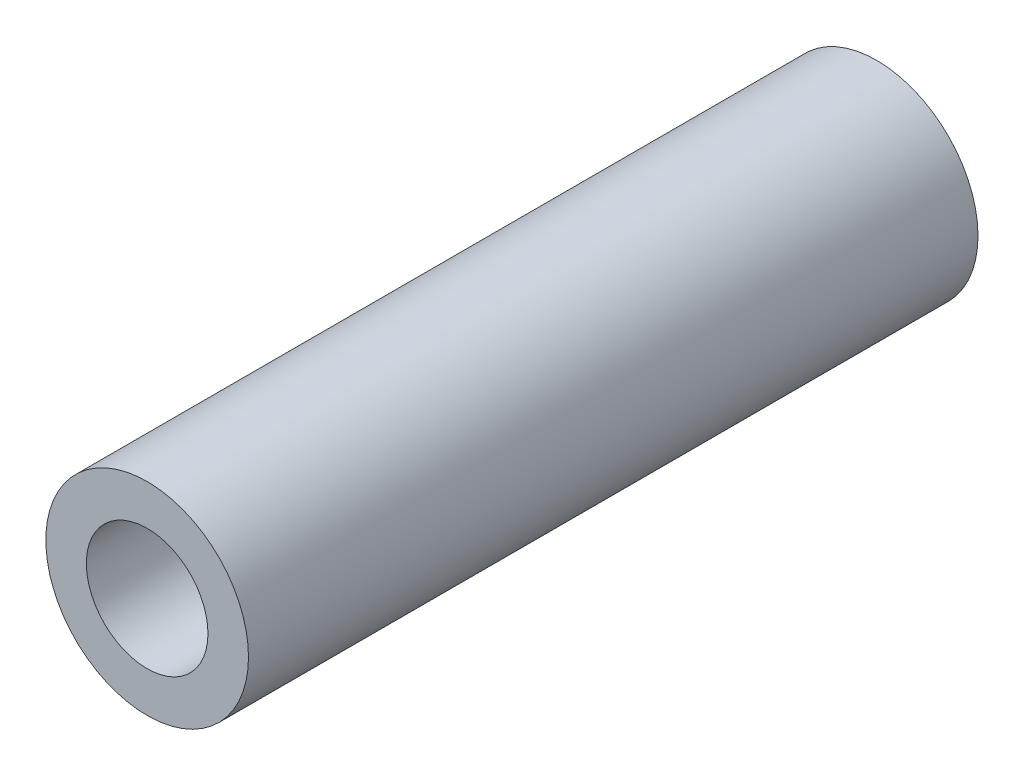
ISO-10303-21;
HEADER;
FILE_DESCRIPTION(('STEP AP214'),'2;1');
FILE_NAME('part.step','',(''),(''),'','','');
FILE_SCHEMA(('AUTOMOTIVE_DESIGN { 1 0 10303 214 1 1 1 1 }'));
ENDSEC;
DATA;
#1=APPLICATION_CONTEXT('core data for automotive mechanical design processes');
#2=APPLICATION_PROTOCOL_DEFINITION('international standard','automotive_design',2000,#1);
#3=PRODUCT_CONTEXT('',#1,'mechanical');
#4=PRODUCT('Part','Part','',(#3));
#5=PRODUCT_RELATED_PRODUCT_CATEGORY('part','',(#4));
#6=PRODUCT_DEFINITION_FORMATION('','',#4);
#7=PRODUCT_DEFINITION_CONTEXT('part definition',#1,'design');
#8=PRODUCT_DEFINITION('design','',#6,#7);
#9=PRODUCT_DEFINITION_SHAPE('','',#8);
#10=(LENGTH_UNIT() NAMED_UNIT(*) SI_UNIT(.MILLI.,.METRE.));
#11=(NAMED_UNIT(*) PLANE_ANGLE_UNIT() SI_UNIT($,.RADIAN.));
#12=(NAMED_UNIT(*) SI_UNIT($,.STERADIAN.) SOLID_ANGLE_UNIT());
#13=UNCERTAINTY_MEASURE_WITH_UNIT(LENGTH_MEASURE(1.E-05),#10,'distance_accuracy_value','');
#14=(GEOMETRIC_REPRESENTATION_CONTEXT(3) GLOBAL_UNCERTAINTY_ASSIGNED_CONTEXT((#13)) GLOBAL_UNIT_ASSIGNED_CONTEXT((#10,
#11,#12)) REPRESENTATION_CONTEXT('',''));
#15=CARTESIAN_POINT('',(0.,0.,0.));
#16=DIRECTION('',(0.,0.,1.));
#17=DIRECTION('',(1.,0.,0.));
#18=AXIS2_PLACEMENT_3D('',#15,#16,#17);
#19=CARTESIAN_POINT('',(0.,0.,108.));
#20=DIRECTION('',(0.,0.,1.));
#21=DIRECTION('',(1.,0.,0.));
#22=AXIS2_PLACEMENT_3D('',#19,#20,#21);
#23=PLANE('',#22);
#24=CARTESIAN_POINT('',(0.,0.,108.));
#25=DIRECTION('',(0.,0.,1.));
#26=DIRECTION('',(1.,0.,0.));
#27=AXIS2_PLACEMENT_3D('',#24,#25,#26);
#28=CIRCLE('',#27,15.);
#29=CARTESIAN_POINT('',(15.,0.,108.));
#30=VERTEX_POINT('',#29);
#31=EDGE_CURVE('E10',#30,#30,#28,.T.);
#32=ORIENTED_EDGE('',*,*,#31,.T.);
#33=EDGE_LOOP('',(#32));
#34=FACE_BOUND('',#33,.T.);
#35=CARTESIAN_POINT('',(0.,0.,108.));
#36=DIRECTION('',(0.,0.,1.));
#37=DIRECTION('',(1.,0.,0.));
#38=AXIS2_PLACEMENT_3D('',#35,#36,#37);
#39=CIRCLE('',#38,9.);
#40=CARTESIAN_POINT('',(9.,0.,108.));
#41=VERTEX_POINT('',#40);
#42=EDGE_CURVE('E41',#41,#41,#39,.T.);
#43=ORIENTED_EDGE('',*,*,#42,.F.);
#44=EDGE_LOOP('',(#43));
#45=FACE_BOUND('',#44,.T.);
#46=ADVANCED_FACE('F30',(#34,#45),#23,.T.);
#47=CARTESIAN_POINT('',(0.,0.,0.));
#48=DIRECTION('',(0.,0.,1.));
#49=DIRECTION('',(1.,0.,0.));
#50=AXIS2_PLACEMENT_3D('',#47,#48,#49);
#51=PLANE('',#50);
#52=CARTESIAN_POINT('',(0.,0.,0.));
#53=DIRECTION('',(0.,0.,1.));
#54=DIRECTION('',(1.,0.,0.));
#55=AXIS2_PLACEMENT_3D('',#52,#53,#54);
#56=CIRCLE('',#55,15.);
#57=CARTESIAN_POINT('',(15.,0.,0.));
#58=VERTEX_POINT('',#57);
#59=EDGE_CURVE('E37',#58,#58,#56,.T.);
#60=ORIENTED_EDGE('',*,*,#59,.F.);
#61=EDGE_LOOP('',(#60));
#62=FACE_BOUND('',#61,.T.);
#63=CARTESIAN_POINT('',(0.,0.,0.));
#64=DIRECTION('',(0.,0.,1.));
#65=DIRECTION('',(1.,0.,0.));
#66=AXIS2_PLACEMENT_3D('',#63,#64,#65);
#67=CIRCLE('',#66,9.);
#68=CARTESIAN_POINT('',(9.,0.,0.));
#69=VERTEX_POINT('',#68);
#70=EDGE_CURVE('E45',#69,#69,#67,.T.);
#71=ORIENTED_EDGE('',*,*,#70,.T.);
#72=EDGE_LOOP('',(#71));
#73=FACE_BOUND('',#72,.T.);
#74=ADVANCED_FACE('F51',(#62,#73),#51,.F.);
#75=CARTESIAN_POINT('',(0.,0.,108.));
#76=DIRECTION('',(0.,0.,-1.));
#77=DIRECTION('',(-1.,0.,0.));
#78=AXIS2_PLACEMENT_3D('',#75,#76,#77);
#79=CYLINDRICAL_SURFACE('',#78,15.);
#80=ORIENTED_EDGE('',*,*,#31,.F.);
#81=EDGE_LOOP('',(#80));
#82=FACE_BOUND('',#81,.T.);
#83=ORIENTED_EDGE('',*,*,#59,.T.);
#84=EDGE_LOOP('',(#83));
#85=FACE_BOUND('',#84,.T.);
#86=ADVANCED_FACE('F32',(#82,#85),#79,.T.);
#87=CARTESIAN_POINT('',(0.,0.,108.));
#88=DIRECTION('',(0.,0.,-1.));
#89=DIRECTION('',(-1.,0.,0.));
#90=AXIS2_PLACEMENT_3D('',#87,#88,#89);
#91=CYLINDRICAL_SURFACE('',#90,9.);
#92=ORIENTED_EDGE('',*,*,#42,.T.);
#93=EDGE_LOOP('',(#92));
#94=FACE_BOUND('',#93,.T.);
#95=ORIENTED_EDGE('',*,*,#70,.F.);
#96=EDGE_LOOP('',(#95));
#97=FACE_BOUND('',#96,.T.);
#98=ADVANCED_FACE('F53',(#94,#97),#91,.F.);
#99=CLOSED_SHELL('',(#46,#74,#86,#98));
#100=MANIFOLD_SOLID_BREP('B2',#99);
#101=ADVANCED_BREP_SHAPE_REPRESENTATION('',(#18,#100),#14);
#102=SHAPE_DEFINITION_REPRESENTATION(#9,#101);
ENDSEC;
END-ISO-10303-21;
